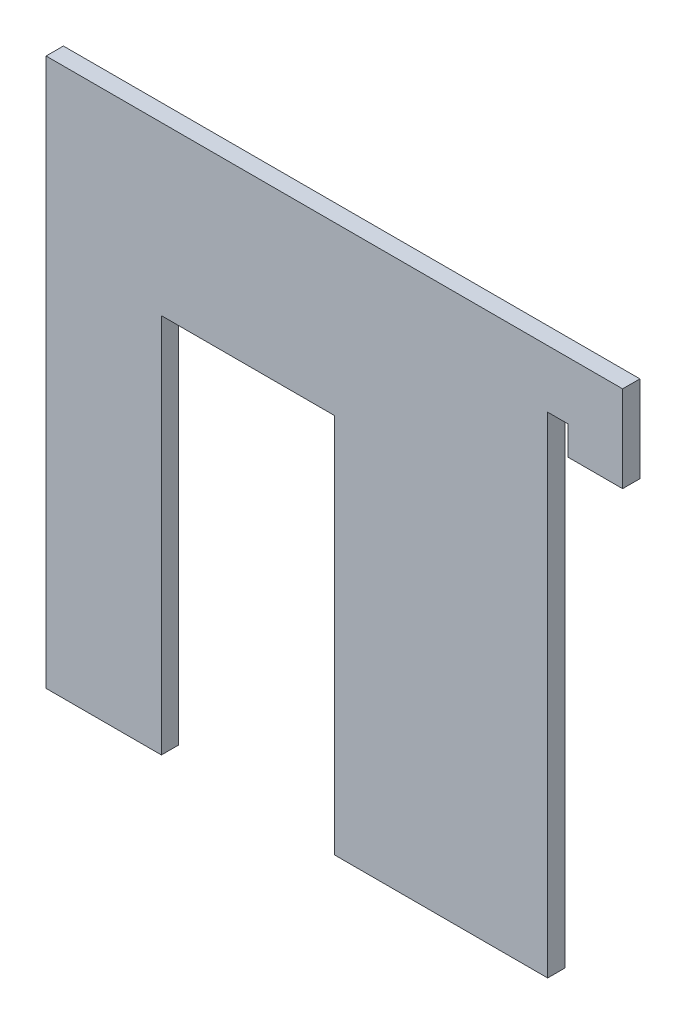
from build123d import *

# Parameters (mm, degrees)
ESQUISSE1_W             = 100
ESQUISSE1_H             = 95
EXTRUSION1_DEPTH        = 3
ESQUISSE2_W             = 30
ESQUISSE2_H             = 66
ENL_V_MAT_EXTRU_1_DEPTH = 3
ESQUISSE3_W             = 13
ESQUISSE3_H             = 80
ENL_V_MAT_EXTRU_2_DEPTH = 3
ESQUISSE4_W             = 3.5
ESQUISSE4_H             = 5
ENL_V_MAT_EXTRU_3_DEPTH = 3


with BuildPart() as part:
    # Esquisse1 → Extrusion1 (new body)
    with BuildSketch(Plane.XY):
        with Locations((50, 47.5)):
            Rectangle(ESQUISSE1_W, ESQUISSE1_H)
    extrude(amount=EXTRUSION1_DEPTH)

    # Esquisse2 → Enl_v. mat.-Extru.1 (cut)
    with BuildSketch(Plane.XY.offset(3)):
        with Locations((35, 33)):
            Rectangle(ESQUISSE2_W, ESQUISSE2_H)
    extrude(amount=-ENL_V_MAT_EXTRU_1_DEPTH, mode=Mode.SUBTRACT)

    # Esquisse3 → Enl_v. mat.-Extru.2 (cut)
    with BuildSketch(Plane.XY.offset(3)):
        with Locations((93.5, 40)):
            Rectangle(ESQUISSE3_W, ESQUISSE3_H)
    extrude(amount=-ENL_V_MAT_EXTRU_2_DEPTH, mode=Mode.SUBTRACT)

    # Esquisse4 → Enl_v. mat.-Extru.3 (cut)
    with BuildSketch(Plane.XY.offset(3)):
        with Locations((88.75, 82.5)):
            Rectangle(ESQUISSE4_W, ESQUISSE4_H)
    extrude(amount=-ENL_V_MAT_EXTRU_3_DEPTH, mode=Mode.SUBTRACT)


solid = part.part
